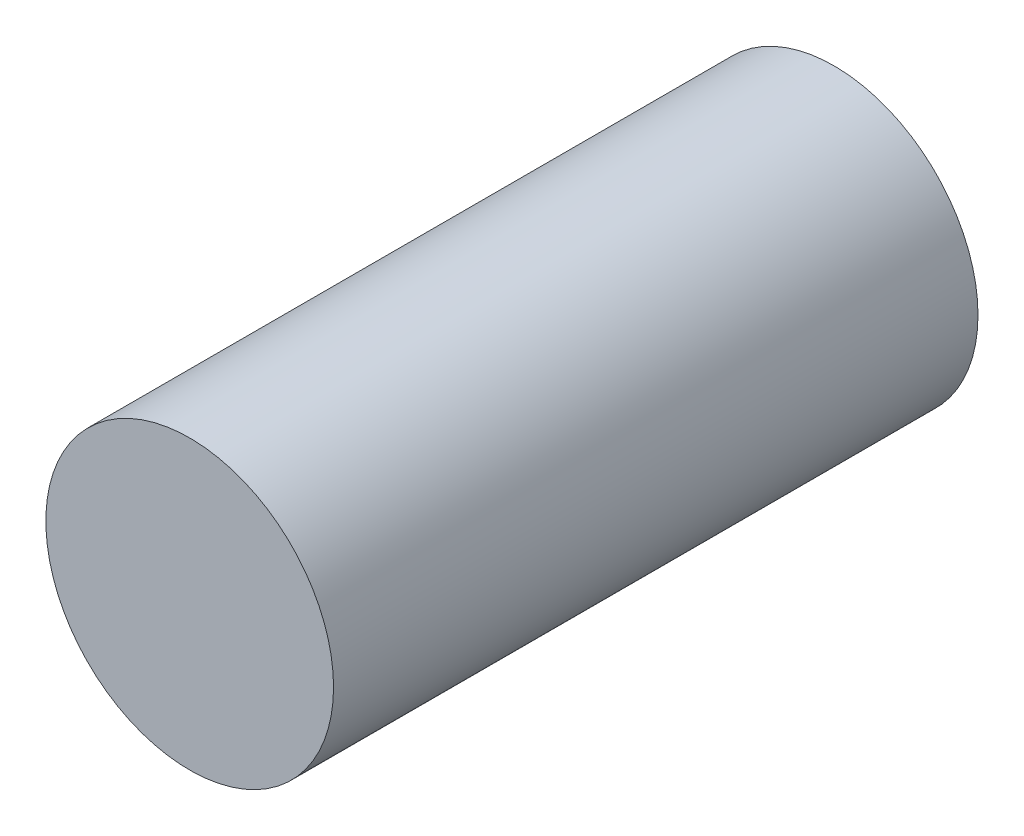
from build123d import *

# Parameters (mm, degrees)
ESQCYLINDRE_R  = 25
CYLINDRE_DEPTH = 112


with BuildPart() as part:
    # EsqCylindre → Cylindre (new body)
    with BuildSketch(Plane.XY):
        Circle(ESQCYLINDRE_R)
    extrude(amount=-CYLINDRE_DEPTH)


solid = part.part
